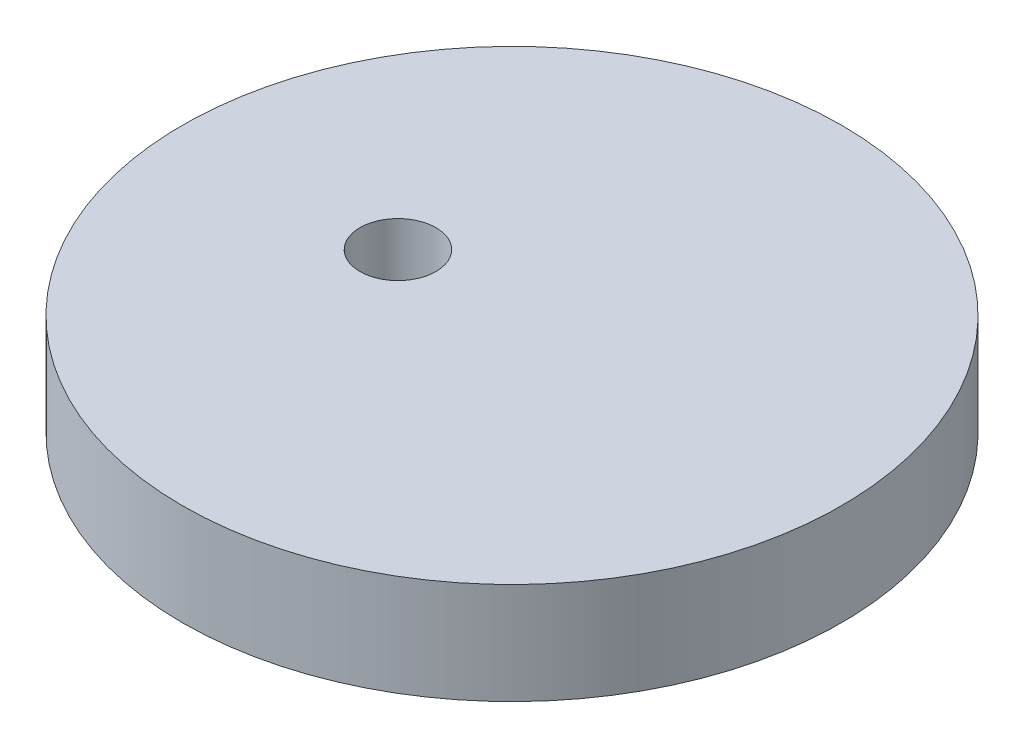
from build123d import *

# Parameters (mm, degrees)
SKIZZE1_R                       = 13
SKIZZE1_R_2                     = 1.5
AUFSATZ_LINEAR_AUSTRAGEN1_DEPTH = 4


with BuildPart() as part:
    # Skizze1 → Aufsatz-Linear austragen1 (new body)
    with BuildSketch(Plane(origin=(0, 0, 0), x_dir=(1, 0, 0), z_dir=(0, 1, 0))):
        with Locations(Location((0, 0, 0), (0, 0, 270))):
            Circle(SKIZZE1_R)
        with Locations(Location((-4.5, 0, 0), (0, 0, 270))):
            Circle(SKIZZE1_R_2, mode=Mode.SUBTRACT)
    extrude(amount=AUFSATZ_LINEAR_AUSTRAGEN1_DEPTH)


solid = part.part
